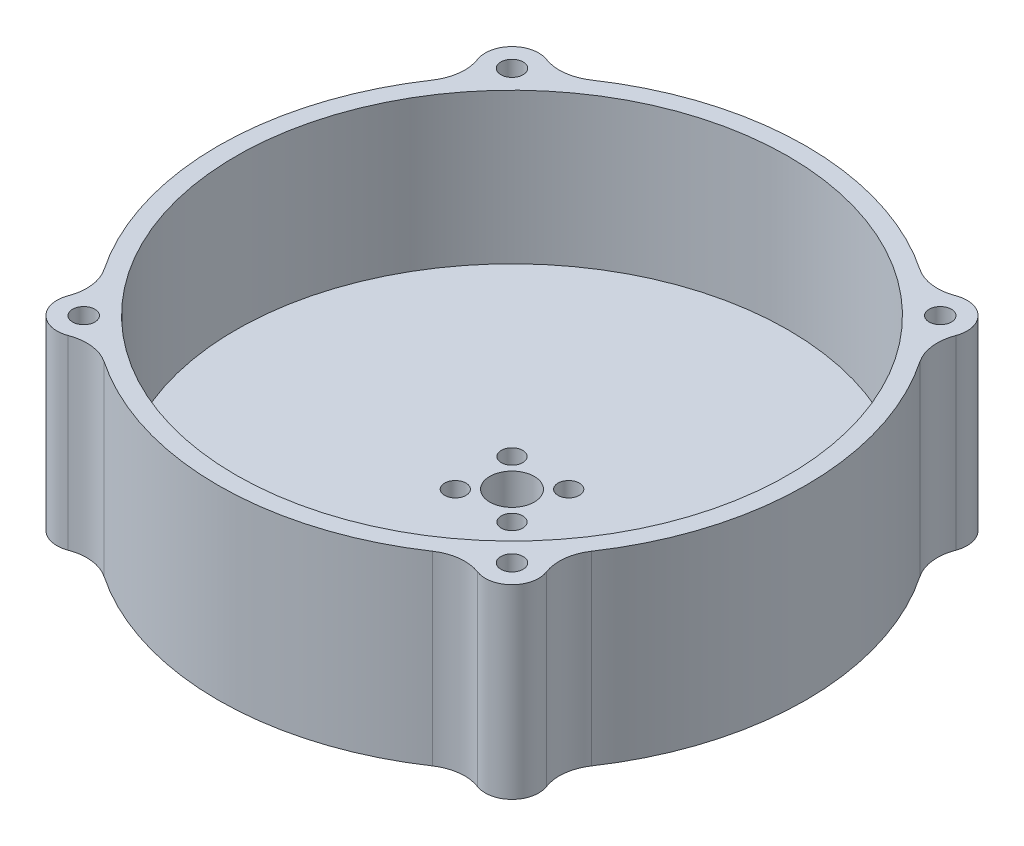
from build123d import *

# Parameters (mm, degrees)
SKETCH1_R                 = 33
BOSS_EXTRUDE1_DEPTH       = 4
SKETCH2_R                 = 33
SKETCH2_R_2               = 31
BOSS_EXTRUDE2_DEPTH       = 16.88
M2_CLEARANCE_HOLE1_D      = 2.4
SKETCH13_R                = 2.5
CUT_EXTRUDE3_DEPTH        = 50.627959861
CUT_EXTRUDE2_DEPTH        = 50.627959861
SKETCH15_R                = 3
BOSS_EXTRUDE3_DEPTH       = 20.88
FILLET1_R                 = 5
CIRPATTERN1_COUNT         = 4
FILLET1_OF_CIRPATTERN1_R  = 5
M3X0_5_TAPPED_HOLE1_D     = 2.5
M3X0_5_TAPPED_HOLE1_DEPTH = 7.5
M3X0_5_TAPPED_HOLE1_TIP   = 0.751075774


with BuildPart() as part:
    # Sketch1 → Boss-Extrude1 (new body)
    with BuildSketch(Plane(origin=(0, 0, 0), x_dir=(1, 0, 0), z_dir=(0, 1, 0))):
        with Locations(Location((0, 0, 0), (0, 0, 270))):
            Circle(SKETCH1_R)
    extrude(amount=BOSS_EXTRUDE1_DEPTH)

    # Sketch2 → Boss-Extrude2 (add)
    with BuildSketch(Plane(origin=(0, 4, 0), x_dir=(1, 0, 0), z_dir=(0, 1, 0))):
        with Locations(Location((0, 0, 0), (0, 0, 270))):
            Circle(SKETCH2_R)
        with Locations(Location((0, 0, 0), (0, 0, 270))):
            Circle(SKETCH2_R_2, mode=Mode.SUBTRACT)
    extrude(amount=BOSS_EXTRUDE2_DEPTH)

    # M2 Clearance Hole1 (through all)
    with Locations(Plane(origin=(0, 0, 0), x_dir=(-1, 0, 0), z_dir=(0, -1, 0))):
        with Locations((3.181980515, 3.181980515), (3.181980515, -3.181980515), (-3.181980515, -3.181980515), (-3.181980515, 3.181980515)):
            Hole(M2_CLEARANCE_HOLE1_D / 2)

    # Sketch13 → Cut-Extrude3 (cut, through all)
    with BuildSketch(Plane(origin=(0, 4, 0), x_dir=(1, 0, 0), z_dir=(0, 1, 0))):
        with Locations(Location((0, 0, 0), (0, 0, 270))):
            Circle(SKETCH13_R)
    extrude(amount=-CUT_EXTRUDE3_DEPTH, mode=Mode.SUBTRACT)

    # Sketch10 → Cut-Extrude2 (cut, through all)
    with BuildSketch(Plane(origin=(0, 4, 0), x_dir=(1, 0, 0), z_dir=(0, 1, 0))):
        with BuildLine():
            Line((13.5, -4), (13.5, 4))
            ThreePointArc((13.5, 4), (15, 5.5), (16.5, 4))
            Line((16.5, 4), (16.5, -4))
            ThreePointArc((16.5, -4), (15, -5.5), (13.5, -4))
        make_face()
    extrude(amount=-CUT_EXTRUDE2_DEPTH, mode=Mode.SUBTRACT)

    # Sketch15 → Boss-Extrude3 (add, through all)
    with BuildSketch(Plane(origin=(0, 20.88, 0), x_dir=(1, 0, 0), z_dir=(0, 1, 0))):
        with Locations((24.04163056, 24.04163056)):
            Circle(SKETCH15_R)
    boss_extrude3 = extrude(amount=-BOSS_EXTRUDE3_DEPTH)

    # Fillet1
    fillet1_edges = [part.edges().sort_by_distance(p)[0] for p in [
        (25.219946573, 10.44, -21.282722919),
        (21.282722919, 10.44, -25.219946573),
    ]]
    fillet(fillet1_edges, radius=FILLET1_R)

    # CirPattern1: Boss-Extrude3 ×4 about axis
    cirpattern1_axis = Axis((0, 0, 0), (0, 1, 0))
    for i in range(1, CIRPATTERN1_COUNT):
        add(boss_extrude3.rotate(cirpattern1_axis, i * 360 / CIRPATTERN1_COUNT))

    # Fillet1 of CirPattern1
    fillet1_of_cirpattern1_edges = [part.edges().sort_by_distance(p)[0] for p in [
        (-21.282722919, 10.44, -25.219946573),
        (-25.219946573, 10.44, -21.282722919),
        (-25.219946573, 10.44, 21.282722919),
        (-21.282722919, 10.44, 25.219946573),
        (21.282722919, 10.44, 25.219946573),
        (25.219946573, 10.44, 21.282722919),
    ]]
    fillet(fillet1_of_cirpattern1_edges, radius=FILLET1_OF_CIRPATTERN1_R)

    # M3x0.5 Tapped Hole1
    with Locations(Plane(origin=(0, 20.88, 0), x_dir=(1, 0, 0), z_dir=(0, 1, 0))):
        with Locations((24.04163056, -24.04163056), (-24.04163056, -24.04163056), (-24.04163056, 24.04163056), (24.04163056, 24.04163056)):
            Hole(M3X0_5_TAPPED_HOLE1_D / 2, depth=M3X0_5_TAPPED_HOLE1_DEPTH)
            with Locations((0, 0, -(M3X0_5_TAPPED_HOLE1_DEPTH + M3X0_5_TAPPED_HOLE1_TIP / 2))):  # 118° drill point
                Cone(0, M3X0_5_TAPPED_HOLE1_D / 2, M3X0_5_TAPPED_HOLE1_TIP, mode=Mode.SUBTRACT)


solid = part.part
